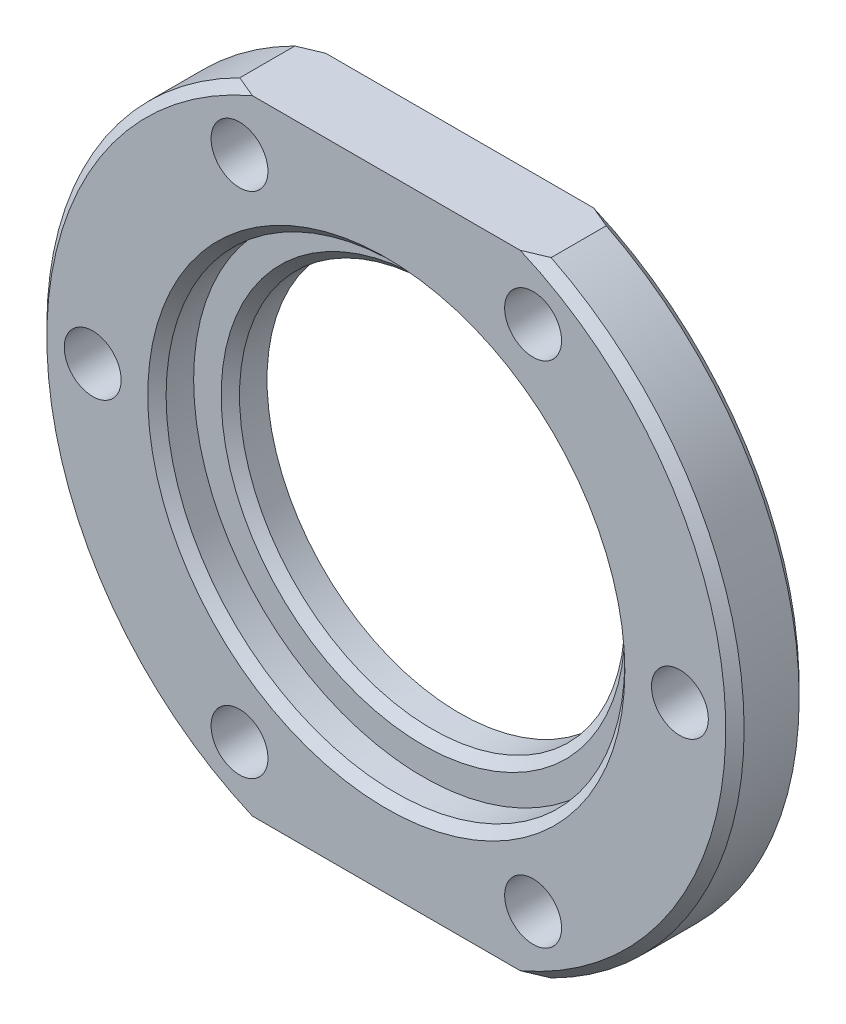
ISO-10303-21;
HEADER;
FILE_DESCRIPTION(('STEP AP214'),'2;1');
FILE_NAME('part.step','',(''),(''),'','','');
FILE_SCHEMA(('AUTOMOTIVE_DESIGN { 1 0 10303 214 1 1 1 1 }'));
ENDSEC;
DATA;
#1=APPLICATION_CONTEXT('core data for automotive mechanical design processes');
#2=APPLICATION_PROTOCOL_DEFINITION('international standard','automotive_design',2000,#1);
#3=PRODUCT_CONTEXT('',#1,'mechanical');
#4=PRODUCT('Part','Part','',(#3));
#5=PRODUCT_RELATED_PRODUCT_CATEGORY('part','',(#4));
#6=PRODUCT_DEFINITION_FORMATION('','',#4);
#7=PRODUCT_DEFINITION_CONTEXT('part definition',#1,'design');
#8=PRODUCT_DEFINITION('design','',#6,#7);
#9=PRODUCT_DEFINITION_SHAPE('','',#8);
#10=(LENGTH_UNIT() NAMED_UNIT(*) SI_UNIT(.MILLI.,.METRE.));
#11=(NAMED_UNIT(*) PLANE_ANGLE_UNIT() SI_UNIT($,.RADIAN.));
#12=(NAMED_UNIT(*) SI_UNIT($,.STERADIAN.) SOLID_ANGLE_UNIT());
#13=UNCERTAINTY_MEASURE_WITH_UNIT(LENGTH_MEASURE(1.E-05),#10,'distance_accuracy_value','');
#14=(GEOMETRIC_REPRESENTATION_CONTEXT(3) GLOBAL_UNCERTAINTY_ASSIGNED_CONTEXT((#13)) GLOBAL_UNIT_ASSIGNED_CONTEXT((#10,
#11,#12)) REPRESENTATION_CONTEXT('',''));
#15=CARTESIAN_POINT('',(0.,0.,0.));
#16=DIRECTION('',(0.,0.,1.));
#17=DIRECTION('',(1.,0.,0.));
#18=AXIS2_PLACEMENT_3D('',#15,#16,#17);
#19=CARTESIAN_POINT('',(0.,0.,4.));
#20=DIRECTION('',(0.,0.,-1.));
#21=DIRECTION('',(-1.,0.,0.));
#22=AXIS2_PLACEMENT_3D('',#19,#20,#21);
#23=CYLINDRICAL_SURFACE('',#22,18.9998743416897);
#24=DIRECTION('',(0.,0.,-1.));
#25=VECTOR('',#24,1.);
#26=CARTESIAN_POINT('',(-8.485,17.,4.));
#27=LINE('',#26,#25);
#28=CARTESIAN_POINT('',(-8.485,17.,3.49999999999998));
#29=VERTEX_POINT('',#28);
#30=CARTESIAN_POINT('',(-8.485,17.,0.500000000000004));
#31=VERTEX_POINT('',#30);
#32=EDGE_CURVE('E125',#29,#31,#27,.T.);
#33=ORIENTED_EDGE('',*,*,#32,.T.);
#34=CARTESIAN_POINT('',(0.,0.,0.500000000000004));
#35=DIRECTION('',(0.,0.,1.));
#36=DIRECTION('',(1.,0.,0.));
#37=AXIS2_PLACEMENT_3D('',#34,#35,#36);
#38=CIRCLE('',#37,18.9998743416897);
#39=CARTESIAN_POINT('',(-8.48500000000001,-17.,0.500000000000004));
#40=VERTEX_POINT('',#39);
#41=EDGE_CURVE('E235',#31,#40,#38,.T.);
#42=ORIENTED_EDGE('',*,*,#41,.T.);
#43=DIRECTION('',(0.,0.,-1.));
#44=VECTOR('',#43,1.);
#45=CARTESIAN_POINT('',(-8.48500000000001,-17.,4.));
#46=LINE('',#45,#44);
#47=CARTESIAN_POINT('',(-8.48500000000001,-17.,3.49999999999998));
#48=VERTEX_POINT('',#47);
#49=EDGE_CURVE('E130',#48,#40,#46,.T.);
#50=ORIENTED_EDGE('',*,*,#49,.F.);
#51=CARTESIAN_POINT('',(0.,0.,3.49999999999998));
#52=DIRECTION('',(0.,0.,1.));
#53=DIRECTION('',(1.,0.,0.));
#54=AXIS2_PLACEMENT_3D('',#51,#52,#53);
#55=CIRCLE('',#54,18.9998743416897);
#56=EDGE_CURVE('E234',#48,#29,#55,.F.);
#57=ORIENTED_EDGE('',*,*,#56,.T.);
#58=EDGE_LOOP('',(#33,#42,#50,#57));
#59=FACE_BOUND('',#58,.T.);
#60=ADVANCED_FACE('F35',(#59),#23,.T.);
#61=CARTESIAN_POINT('',(-8.48500000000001,-17.,4.));
#62=DIRECTION('',(0.,1.,0.));
#63=DIRECTION('',(0.,0.,1.));
#64=AXIS2_PLACEMENT_3D('',#61,#62,#63);
#65=PLANE('',#64);
#66=DIRECTION('',(1.,0.,0.));
#67=VECTOR('',#66,1.);
#68=CARTESIAN_POINT('',(-8.48500000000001,-17.,0.));
#69=LINE('',#68,#67);
#70=CARTESIAN_POINT('',(-7.29694118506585,-17.,0.));
#71=VERTEX_POINT('',#70);
#72=CARTESIAN_POINT('',(7.29694118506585,-17.,0.));
#73=VERTEX_POINT('',#72);
#74=EDGE_CURVE('E231',#71,#73,#69,.T.);
#75=ORIENTED_EDGE('',*,*,#74,.T.);
#76=CARTESIAN_POINT('',(7.29694118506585,-17.,0.));
#77=CARTESIAN_POINT('',(7.39687946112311,-17.,0.0394189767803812));
#78=CARTESIAN_POINT('',(7.49658395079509,-17.,0.0794293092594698));
#79=CARTESIAN_POINT('',(7.69551600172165,-17.,0.160584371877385));
#80=CARTESIAN_POINT('',(7.79474361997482,-17.,0.201728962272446));
#81=CARTESIAN_POINT('',(7.99273655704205,-17.,0.28511369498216));
#82=CARTESIAN_POINT('',(8.09150187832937,-17.,0.327353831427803));
#83=CARTESIAN_POINT('',(8.28858707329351,-17.,0.41289369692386));
#84=CARTESIAN_POINT('',(8.38690689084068,-17.,0.456193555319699));
#85=CARTESIAN_POINT('',(8.48500000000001,-17.,0.499999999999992));
#86=B_SPLINE_CURVE_WITH_KNOTS('',3,(#76,#77,#78,#79,#80,#81,#82,#83,#84,#85),.UNSPECIFIED.,.F.,
.F.,(4,2,2,2,4),(0.,0.32229172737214,0.644543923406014,0.966794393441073,1.28908439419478),.UNSPECIFIED.);
#87=CARTESIAN_POINT('',(8.485,-17.,0.500000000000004));
#88=VERTEX_POINT('',#87);
#89=EDGE_CURVE('E197',#73,#88,#86,.T.);
#90=ORIENTED_EDGE('',*,*,#89,.T.);
#91=DIRECTION('',(0.,0.,-1.));
#92=VECTOR('',#91,1.);
#93=CARTESIAN_POINT('',(8.485,-17.,4.));
#94=LINE('',#93,#92);
#95=CARTESIAN_POINT('',(8.485,-17.,3.49999999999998));
#96=VERTEX_POINT('',#95);
#97=EDGE_CURVE('E124',#96,#88,#94,.T.);
#98=ORIENTED_EDGE('',*,*,#97,.F.);
#99=CARTESIAN_POINT('',(8.485,-17.,3.49999999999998));
#100=CARTESIAN_POINT('',(8.38690689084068,-17.,3.54380644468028));
#101=CARTESIAN_POINT('',(8.2885870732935,-17.,3.58710630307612));
#102=CARTESIAN_POINT('',(8.09150187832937,-17.,3.67264616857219));
#103=CARTESIAN_POINT('',(7.99273655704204,-17.,3.71488630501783));
#104=CARTESIAN_POINT('',(7.7947436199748,-17.,3.79827103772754));
#105=CARTESIAN_POINT('',(7.69551600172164,-17.,3.8394156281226));
#106=CARTESIAN_POINT('',(7.49658395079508,-17.,3.92057069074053));
#107=CARTESIAN_POINT('',(7.3968794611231,-17.,3.96058102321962));
#108=CARTESIAN_POINT('',(7.29694118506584,-17.,4.00000000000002));
#109=B_SPLINE_CURVE_WITH_KNOTS('',3,(#99,#100,#101,#102,#103,#104,#105,#106,#107,#108),
.UNSPECIFIED.,.F.,.F.,(4,2,2,2,4),(0.,0.322290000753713,0.644540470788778,0.966792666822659,
1.2890843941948),.UNSPECIFIED.);
#110=CARTESIAN_POINT('',(7.29694118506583,-17.,4.));
#111=VERTEX_POINT('',#110);
#112=EDGE_CURVE('E129',#96,#111,#109,.T.);
#113=ORIENTED_EDGE('',*,*,#112,.T.);
#114=DIRECTION('',(1.,0.,0.));
#115=VECTOR('',#114,1.);
#116=CARTESIAN_POINT('',(-8.48500000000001,-17.,4.));
#117=LINE('',#116,#115);
#118=CARTESIAN_POINT('',(-7.29694118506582,-17.,4.));
#119=VERTEX_POINT('',#118);
#120=EDGE_CURVE('E230',#119,#111,#117,.T.);
#121=ORIENTED_EDGE('',*,*,#120,.F.);
#122=CARTESIAN_POINT('',(-7.29694118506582,-17.,4.));
#123=CARTESIAN_POINT('',(-7.39687946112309,-17.,3.96058102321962));
#124=CARTESIAN_POINT('',(-7.49658395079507,-17.,3.92057069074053));
#125=CARTESIAN_POINT('',(-7.69551600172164,-17.,3.83941562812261));
#126=CARTESIAN_POINT('',(-7.7947436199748,-17.,3.79827103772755));
#127=CARTESIAN_POINT('',(-7.99273655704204,-17.,3.71488630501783));
#128=CARTESIAN_POINT('',(-8.09150187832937,-17.,3.67264616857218));
#129=CARTESIAN_POINT('',(-8.28858707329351,-17.,3.58710630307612));
#130=CARTESIAN_POINT('',(-8.38690689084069,-17.,3.54380644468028));
#131=CARTESIAN_POINT('',(-8.48500000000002,-17.,3.49999999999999));
#132=B_SPLINE_CURVE_WITH_KNOTS('',3,(#122,#123,#124,#125,#126,#127,#128,#129,#130,#131),
.UNSPECIFIED.,.F.,.F.,(4,2,2,2,4),(0.,0.322291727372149,0.644543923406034,0.966794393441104,
1.28908439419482),.UNSPECIFIED.);
#133=EDGE_CURVE('E59',#119,#48,#132,.T.);
#134=ORIENTED_EDGE('',*,*,#133,.T.);
#135=ORIENTED_EDGE('',*,*,#49,.T.);
#136=CARTESIAN_POINT('',(-8.48500000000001,-17.,0.500000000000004));
#137=CARTESIAN_POINT('',(-8.38690689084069,-17.,0.456193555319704));
#138=CARTESIAN_POINT('',(-8.28858707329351,-17.,0.412893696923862));
#139=CARTESIAN_POINT('',(-8.09150187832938,-17.,0.327353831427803));
#140=CARTESIAN_POINT('',(-7.99273655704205,-17.,0.285113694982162));
#141=CARTESIAN_POINT('',(-7.79474361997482,-17.,0.20172896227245));
#142=CARTESIAN_POINT('',(-7.69551600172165,-17.,0.16058437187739));
#143=CARTESIAN_POINT('',(-7.49658395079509,-17.,0.0794293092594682));
#144=CARTESIAN_POINT('',(-7.39687946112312,-17.,0.0394189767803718));
#145=CARTESIAN_POINT('',(-7.29694118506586,-17.,0.));
#146=B_SPLINE_CURVE_WITH_KNOTS('',3,(#136,#137,#138,#139,#140,#141,#142,#143,#144,#145),
.UNSPECIFIED.,.F.,.F.,(4,2,2,2,4),(0.,0.322290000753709,0.64454047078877,0.966792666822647,
1.28908439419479),.UNSPECIFIED.);
#147=EDGE_CURVE('E51',#40,#71,#146,.T.);
#148=ORIENTED_EDGE('',*,*,#147,.T.);
#149=EDGE_LOOP('',(#75,#90,#98,#113,#121,#134,#135,#148));
#150=FACE_BOUND('',#149,.T.);
#151=ADVANCED_FACE('F208',(#150),#65,.F.);
#152=CARTESIAN_POINT('',(0.,0.,4.));
#153=DIRECTION('',(0.,0.,-1.));
#154=DIRECTION('',(-1.,0.,0.));
#155=AXIS2_PLACEMENT_3D('',#152,#153,#154);
#156=CYLINDRICAL_SURFACE('',#155,18.9998743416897);
#157=ORIENTED_EDGE('',*,*,#97,.T.);
#158=CARTESIAN_POINT('',(0.,0.,0.500000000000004));
#159=DIRECTION('',(0.,0.,1.));
#160=DIRECTION('',(1.,0.,0.));
#161=AXIS2_PLACEMENT_3D('',#158,#159,#160);
#162=CIRCLE('',#161,18.9998743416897);
#163=CARTESIAN_POINT('',(8.485,17.,0.500000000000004));
#164=VERTEX_POINT('',#163);
#165=EDGE_CURVE('E123',#88,#164,#162,.T.);
#166=ORIENTED_EDGE('',*,*,#165,.T.);
#167=DIRECTION('',(0.,0.,-1.));
#168=VECTOR('',#167,1.);
#169=CARTESIAN_POINT('',(8.485,17.,4.));
#170=LINE('',#169,#168);
#171=CARTESIAN_POINT('',(8.485,17.,3.49999999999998));
#172=VERTEX_POINT('',#171);
#173=EDGE_CURVE('E106',#172,#164,#170,.T.);
#174=ORIENTED_EDGE('',*,*,#173,.F.);
#175=CARTESIAN_POINT('',(0.,0.,3.49999999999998));
#176=DIRECTION('',(0.,0.,1.));
#177=DIRECTION('',(1.,0.,0.));
#178=AXIS2_PLACEMENT_3D('',#175,#176,#177);
#179=CIRCLE('',#178,18.9998743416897);
#180=EDGE_CURVE('E120',#172,#96,#179,.F.);
#181=ORIENTED_EDGE('',*,*,#180,.T.);
#182=EDGE_LOOP('',(#157,#166,#174,#181));
#183=FACE_BOUND('',#182,.T.);
#184=ADVANCED_FACE('F119',(#183),#156,.T.);
#185=CARTESIAN_POINT('',(-8.485,17.,4.));
#186=DIRECTION('',(0.,-1.,0.));
#187=DIRECTION('',(0.,0.,-1.));
#188=AXIS2_PLACEMENT_3D('',#185,#186,#187);
#189=PLANE('',#188);
#190=ORIENTED_EDGE('',*,*,#173,.T.);
#191=CARTESIAN_POINT('',(8.485,17.,0.500000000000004));
#192=CARTESIAN_POINT('',(8.38690689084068,17.,0.456193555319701));
#193=CARTESIAN_POINT('',(8.28858707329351,17.,0.412893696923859));
#194=CARTESIAN_POINT('',(8.09150187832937,17.,0.327353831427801));
#195=CARTESIAN_POINT('',(7.99273655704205,17.,0.285113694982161));
#196=CARTESIAN_POINT('',(7.79474361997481,17.,0.20172896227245));
#197=CARTESIAN_POINT('',(7.69551600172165,17.,0.16058437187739));
#198=CARTESIAN_POINT('',(7.49658395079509,17.,0.079429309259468));
#199=CARTESIAN_POINT('',(7.39687946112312,17.,0.0394189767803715));
#200=CARTESIAN_POINT('',(7.29694118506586,17.,0.));
#201=B_SPLINE_CURVE_WITH_KNOTS('',3,(#191,#192,#193,#194,#195,#196,#197,#198,#199,#200),
.UNSPECIFIED.,.F.,.F.,(4,2,2,2,4),(0.,0.322290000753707,0.644540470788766,0.96679266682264,
1.28908439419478),.UNSPECIFIED.);
#202=CARTESIAN_POINT('',(7.29694118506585,17.,0.));
#203=VERTEX_POINT('',#202);
#204=EDGE_CURVE('E170',#164,#203,#201,.T.);
#205=ORIENTED_EDGE('',*,*,#204,.T.);
#206=DIRECTION('',(-1.,0.,0.));
#207=VECTOR('',#206,1.);
#208=CARTESIAN_POINT('',(-8.485,17.,0.));
#209=LINE('',#208,#207);
#210=CARTESIAN_POINT('',(-7.29694118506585,17.,0.));
#211=VERTEX_POINT('',#210);
#212=EDGE_CURVE('E225',#203,#211,#209,.T.);
#213=ORIENTED_EDGE('',*,*,#212,.T.);
#214=CARTESIAN_POINT('',(-7.29694118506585,17.,0.));
#215=CARTESIAN_POINT('',(-7.39687946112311,17.,0.0394189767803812));
#216=CARTESIAN_POINT('',(-7.49658395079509,17.,0.0794293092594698));
#217=CARTESIAN_POINT('',(-7.69551600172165,17.,0.160584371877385));
#218=CARTESIAN_POINT('',(-7.79474361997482,17.,0.201728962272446));
#219=CARTESIAN_POINT('',(-7.99273655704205,17.,0.28511369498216));
#220=CARTESIAN_POINT('',(-8.09150187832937,17.,0.327353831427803));
#221=CARTESIAN_POINT('',(-8.28858707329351,17.,0.41289369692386));
#222=CARTESIAN_POINT('',(-8.38690689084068,17.,0.456193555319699));
#223=CARTESIAN_POINT('',(-8.48500000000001,17.,0.499999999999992));
#224=B_SPLINE_CURVE_WITH_KNOTS('',3,(#214,#215,#216,#217,#218,#219,#220,#221,#222,#223),
.UNSPECIFIED.,.F.,.F.,(4,2,2,2,4),(0.,0.32229172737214,0.644543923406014,0.966794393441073,
1.28908439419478),.UNSPECIFIED.);
#225=EDGE_CURVE('E113',#211,#31,#224,.T.);
#226=ORIENTED_EDGE('',*,*,#225,.T.);
#227=ORIENTED_EDGE('',*,*,#32,.F.);
#228=CARTESIAN_POINT('',(-8.485,17.,3.49999999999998));
#229=CARTESIAN_POINT('',(-8.38690689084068,17.,3.54380644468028));
#230=CARTESIAN_POINT('',(-8.2885870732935,17.,3.58710630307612));
#231=CARTESIAN_POINT('',(-8.09150187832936,17.,3.67264616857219));
#232=CARTESIAN_POINT('',(-7.99273655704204,17.,3.71488630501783));
#233=CARTESIAN_POINT('',(-7.7947436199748,17.,3.79827103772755));
#234=CARTESIAN_POINT('',(-7.69551600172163,17.,3.83941562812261));
#235=CARTESIAN_POINT('',(-7.49658395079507,17.,3.92057069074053));
#236=CARTESIAN_POINT('',(-7.39687946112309,17.,3.96058102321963));
#237=CARTESIAN_POINT('',(-7.29694118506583,17.,4.00000000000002));
#238=B_SPLINE_CURVE_WITH_KNOTS('',3,(#228,#229,#230,#231,#232,#233,#234,#235,#236,#237),
.UNSPECIFIED.,.F.,.F.,(4,2,2,2,4),(0.,0.322290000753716,0.644540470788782,0.966792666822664,
1.28908439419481),.UNSPECIFIED.);
#239=CARTESIAN_POINT('',(-7.29694118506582,17.,4.));
#240=VERTEX_POINT('',#239);
#241=EDGE_CURVE('E114',#29,#240,#238,.T.);
#242=ORIENTED_EDGE('',*,*,#241,.T.);
#243=DIRECTION('',(-1.,0.,0.));
#244=VECTOR('',#243,1.);
#245=CARTESIAN_POINT('',(-8.485,17.,4.));
#246=LINE('',#245,#244);
#247=CARTESIAN_POINT('',(7.29694118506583,17.,4.));
#248=VERTEX_POINT('',#247);
#249=EDGE_CURVE('E108',#248,#240,#246,.T.);
#250=ORIENTED_EDGE('',*,*,#249,.F.);
#251=CARTESIAN_POINT('',(7.29694118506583,17.,4.));
#252=CARTESIAN_POINT('',(7.3968794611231,17.,3.96058102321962));
#253=CARTESIAN_POINT('',(7.49658395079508,17.,3.92057069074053));
#254=CARTESIAN_POINT('',(7.69551600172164,17.,3.83941562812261));
#255=CARTESIAN_POINT('',(7.7947436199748,17.,3.79827103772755));
#256=CARTESIAN_POINT('',(7.99273655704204,17.,3.71488630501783));
#257=CARTESIAN_POINT('',(8.09150187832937,17.,3.67264616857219));
#258=CARTESIAN_POINT('',(8.2885870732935,17.,3.58710630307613));
#259=CARTESIAN_POINT('',(8.38690689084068,17.,3.54380644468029));
#260=CARTESIAN_POINT('',(8.48500000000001,17.,3.49999999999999));
#261=B_SPLINE_CURVE_WITH_KNOTS('',3,(#251,#252,#253,#254,#255,#256,#257,#258,#259,#260),
.UNSPECIFIED.,.F.,.F.,(4,2,2,2,4),(0.,0.322291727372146,0.644543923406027,0.96679439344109,
1.2890843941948),.UNSPECIFIED.);
#262=EDGE_CURVE('E103',#248,#172,#261,.T.);
#263=ORIENTED_EDGE('',*,*,#262,.T.);
#264=EDGE_LOOP('',(#190,#205,#213,#226,#227,#242,#250,#263));
#265=FACE_BOUND('',#264,.T.);
#266=ADVANCED_FACE('F105',(#265),#189,.F.);
#267=CARTESIAN_POINT('',(0.,0.,4.));
#268=DIRECTION('',(0.,0.,1.));
#269=DIRECTION('',(1.,0.,0.));
#270=AXIS2_PLACEMENT_3D('',#267,#268,#269);
#271=PLANE('',#270);
#272=CARTESIAN_POINT('',(0.,0.,4.));
#273=DIRECTION('',(0.,0.,1.));
#274=DIRECTION('',(1.,0.,0.));
#275=AXIS2_PLACEMENT_3D('',#272,#273,#274);
#276=CIRCLE('',#275,13.);
#277=CARTESIAN_POINT('',(13.,0.,4.));
#278=VERTEX_POINT('',#277);
#279=EDGE_CURVE('E240',#278,#278,#276,.F.);
#280=ORIENTED_EDGE('',*,*,#279,.T.);
#281=EDGE_LOOP('',(#280));
#282=FACE_BOUND('',#281,.T.);
#283=CARTESIAN_POINT('',(-16.,0.,4.));
#284=DIRECTION('',(0.,0.,1.));
#285=DIRECTION('',(1.,0.,0.));
#286=AXIS2_PLACEMENT_3D('',#283,#284,#285);
#287=CIRCLE('',#286,1.55);
#288=CARTESIAN_POINT('',(-14.45,0.,4.));
#289=VERTEX_POINT('',#288);
#290=EDGE_CURVE('E284',#289,#289,#287,.T.);
#291=ORIENTED_EDGE('',*,*,#290,.F.);
#292=EDGE_LOOP('',(#291));
#293=FACE_BOUND('',#292,.T.);
#294=CARTESIAN_POINT('',(-8.00000000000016,-13.8564064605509,4.));
#295=DIRECTION('',(0.,0.,1.));
#296=DIRECTION('',(1.,0.,0.));
#297=AXIS2_PLACEMENT_3D('',#294,#295,#296);
#298=CIRCLE('',#297,1.55);
#299=CARTESIAN_POINT('',(-6.45000000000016,-13.8564064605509,4.));
#300=VERTEX_POINT('',#299);
#301=EDGE_CURVE('E470',#300,#300,#298,.T.);
#302=ORIENTED_EDGE('',*,*,#301,.F.);
#303=EDGE_LOOP('',(#302));
#304=FACE_BOUND('',#303,.T.);
#305=CARTESIAN_POINT('',(7.99999999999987,-13.8564064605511,4.));
#306=DIRECTION('',(0.,0.,1.));
#307=DIRECTION('',(1.,0.,0.));
#308=AXIS2_PLACEMENT_3D('',#305,#306,#307);
#309=CIRCLE('',#308,1.55);
#310=CARTESIAN_POINT('',(9.54999999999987,-13.8564064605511,4.));
#311=VERTEX_POINT('',#310);
#312=EDGE_CURVE('E464',#311,#311,#309,.T.);
#313=ORIENTED_EDGE('',*,*,#312,.F.);
#314=EDGE_LOOP('',(#313));
#315=FACE_BOUND('',#314,.T.);
#316=CARTESIAN_POINT('',(16.,-1.1172740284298E-13,4.));
#317=DIRECTION('',(0.,0.,1.));
#318=DIRECTION('',(1.,0.,0.));
#319=AXIS2_PLACEMENT_3D('',#316,#317,#318);
#320=CIRCLE('',#319,1.55);
#321=CARTESIAN_POINT('',(17.55,-1.1172740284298E-13,4.));
#322=VERTEX_POINT('',#321);
#323=EDGE_CURVE('E453',#322,#322,#320,.T.);
#324=ORIENTED_EDGE('',*,*,#323,.F.);
#325=EDGE_LOOP('',(#324));
#326=FACE_BOUND('',#325,.T.);
#327=CARTESIAN_POINT('',(8.00000000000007,13.856406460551,4.));
#328=DIRECTION('',(0.,0.,1.));
#329=DIRECTION('',(1.,0.,0.));
#330=AXIS2_PLACEMENT_3D('',#327,#328,#329);
#331=CIRCLE('',#330,1.55);
#332=CARTESIAN_POINT('',(9.55000000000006,13.856406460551,4.));
#333=VERTEX_POINT('',#332);
#334=EDGE_CURVE('E463',#333,#333,#331,.T.);
#335=ORIENTED_EDGE('',*,*,#334,.F.);
#336=EDGE_LOOP('',(#335));
#337=FACE_BOUND('',#336,.T.);
#338=CARTESIAN_POINT('',(-7.99999999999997,13.856406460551,4.));
#339=DIRECTION('',(0.,0.,1.));
#340=DIRECTION('',(1.,0.,0.));
#341=AXIS2_PLACEMENT_3D('',#338,#339,#340);
#342=CIRCLE('',#341,1.55);
#343=CARTESIAN_POINT('',(-6.44999999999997,13.856406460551,4.));
#344=VERTEX_POINT('',#343);
#345=EDGE_CURVE('E467',#344,#344,#342,.T.);
#346=ORIENTED_EDGE('',*,*,#345,.F.);
#347=EDGE_LOOP('',(#346));
#348=FACE_BOUND('',#347,.T.);
#349=ORIENTED_EDGE('',*,*,#120,.T.);
#350=CARTESIAN_POINT('',(0.,0.,4.));
#351=DIRECTION('',(0.,0.,1.));
#352=DIRECTION('',(1.,0.,0.));
#353=AXIS2_PLACEMENT_3D('',#350,#351,#352);
#354=CIRCLE('',#353,18.4998743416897);
#355=EDGE_CURVE('E248',#111,#248,#354,.T.);
#356=ORIENTED_EDGE('',*,*,#355,.T.);
#357=ORIENTED_EDGE('',*,*,#249,.T.);
#358=CARTESIAN_POINT('',(0.,0.,4.));
#359=DIRECTION('',(0.,0.,1.));
#360=DIRECTION('',(1.,0.,0.));
#361=AXIS2_PLACEMENT_3D('',#358,#359,#360);
#362=CIRCLE('',#361,18.4998743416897);
#363=EDGE_CURVE('E245',#240,#119,#362,.T.);
#364=ORIENTED_EDGE('',*,*,#363,.T.);
#365=EDGE_LOOP('',(#349,#356,#357,#364));
#366=FACE_BOUND('',#365,.T.);
#367=ADVANCED_FACE('F157',(#282,#293,#304,#315,#326,#337,#348,#366),#271,.T.);
#368=CARTESIAN_POINT('',(0.,0.,0.));
#369=DIRECTION('',(0.,0.,1.));
#370=DIRECTION('',(1.,0.,0.));
#371=AXIS2_PLACEMENT_3D('',#368,#369,#370);
#372=PLANE('',#371);
#373=CARTESIAN_POINT('',(-16.,0.,0.));
#374=DIRECTION('',(0.,0.,1.));
#375=DIRECTION('',(1.,0.,0.));
#376=AXIS2_PLACEMENT_3D('',#373,#374,#375);
#377=CIRCLE('',#376,1.55);
#378=CARTESIAN_POINT('',(-14.45,0.,0.));
#379=VERTEX_POINT('',#378);
#380=EDGE_CURVE('E135',#379,#379,#377,.T.);
#381=ORIENTED_EDGE('',*,*,#380,.T.);
#382=EDGE_LOOP('',(#381));
#383=FACE_BOUND('',#382,.T.);
#384=CARTESIAN_POINT('',(-8.00000000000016,-13.8564064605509,0.));
#385=DIRECTION('',(0.,0.,1.));
#386=DIRECTION('',(1.,0.,0.));
#387=AXIS2_PLACEMENT_3D('',#384,#385,#386);
#388=CIRCLE('',#387,1.55);
#389=CARTESIAN_POINT('',(-6.45000000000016,-13.8564064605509,0.));
#390=VERTEX_POINT('',#389);
#391=EDGE_CURVE('E277',#390,#390,#388,.T.);
#392=ORIENTED_EDGE('',*,*,#391,.T.);
#393=EDGE_LOOP('',(#392));
#394=FACE_BOUND('',#393,.T.);
#395=CARTESIAN_POINT('',(7.99999999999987,-13.8564064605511,0.));
#396=DIRECTION('',(0.,0.,1.));
#397=DIRECTION('',(1.,0.,0.));
#398=AXIS2_PLACEMENT_3D('',#395,#396,#397);
#399=CIRCLE('',#398,1.55);
#400=CARTESIAN_POINT('',(9.54999999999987,-13.8564064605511,0.));
#401=VERTEX_POINT('',#400);
#402=EDGE_CURVE('E290',#401,#401,#399,.T.);
#403=ORIENTED_EDGE('',*,*,#402,.T.);
#404=EDGE_LOOP('',(#403));
#405=FACE_BOUND('',#404,.T.);
#406=CARTESIAN_POINT('',(16.,-1.1172740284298E-13,0.));
#407=DIRECTION('',(0.,0.,1.));
#408=DIRECTION('',(1.,0.,0.));
#409=AXIS2_PLACEMENT_3D('',#406,#407,#408);
#410=CIRCLE('',#409,1.55);
#411=CARTESIAN_POINT('',(17.55,-1.1172740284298E-13,0.));
#412=VERTEX_POINT('',#411);
#413=EDGE_CURVE('E287',#412,#412,#410,.T.);
#414=ORIENTED_EDGE('',*,*,#413,.T.);
#415=EDGE_LOOP('',(#414));
#416=FACE_BOUND('',#415,.T.);
#417=CARTESIAN_POINT('',(8.00000000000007,13.856406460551,0.));
#418=DIRECTION('',(0.,0.,1.));
#419=DIRECTION('',(1.,0.,0.));
#420=AXIS2_PLACEMENT_3D('',#417,#418,#419);
#421=CIRCLE('',#420,1.55);
#422=CARTESIAN_POINT('',(9.55000000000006,13.856406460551,0.));
#423=VERTEX_POINT('',#422);
#424=EDGE_CURVE('E283',#423,#423,#421,.T.);
#425=ORIENTED_EDGE('',*,*,#424,.T.);
#426=EDGE_LOOP('',(#425));
#427=FACE_BOUND('',#426,.T.);
#428=CARTESIAN_POINT('',(-7.99999999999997,13.856406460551,0.));
#429=DIRECTION('',(0.,0.,1.));
#430=DIRECTION('',(1.,0.,0.));
#431=AXIS2_PLACEMENT_3D('',#428,#429,#430);
#432=CIRCLE('',#431,1.55);
#433=CARTESIAN_POINT('',(-6.44999999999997,13.856406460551,0.));
#434=VERTEX_POINT('',#433);
#435=EDGE_CURVE('E280',#434,#434,#432,.T.);
#436=ORIENTED_EDGE('',*,*,#435,.T.);
#437=EDGE_LOOP('',(#436));
#438=FACE_BOUND('',#437,.T.);
#439=CARTESIAN_POINT('',(0.,0.,0.));
#440=DIRECTION('',(0.,0.,1.));
#441=DIRECTION('',(1.,0.,0.));
#442=AXIS2_PLACEMENT_3D('',#439,#440,#441);
#443=CIRCLE('',#442,10.5);
#444=CARTESIAN_POINT('',(10.5,0.,0.));
#445=VERTEX_POINT('',#444);
#446=EDGE_CURVE('E270',#445,#445,#443,.T.);
#447=ORIENTED_EDGE('',*,*,#446,.T.);
#448=EDGE_LOOP('',(#447));
#449=FACE_BOUND('',#448,.T.);
#450=ORIENTED_EDGE('',*,*,#212,.F.);
#451=CARTESIAN_POINT('',(0.,0.,0.));
#452=DIRECTION('',(0.,0.,1.));
#453=DIRECTION('',(1.,0.,0.));
#454=AXIS2_PLACEMENT_3D('',#451,#452,#453);
#455=CIRCLE('',#454,18.4998743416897);
#456=EDGE_CURVE('E219',#203,#73,#455,.F.);
#457=ORIENTED_EDGE('',*,*,#456,.T.);
#458=ORIENTED_EDGE('',*,*,#74,.F.);
#459=CARTESIAN_POINT('',(0.,0.,0.));
#460=DIRECTION('',(0.,0.,1.));
#461=DIRECTION('',(1.,0.,0.));
#462=AXIS2_PLACEMENT_3D('',#459,#460,#461);
#463=CIRCLE('',#462,18.4998743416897);
#464=EDGE_CURVE('E220',#71,#211,#463,.F.);
#465=ORIENTED_EDGE('',*,*,#464,.T.);
#466=EDGE_LOOP('',(#450,#457,#458,#465));
#467=FACE_BOUND('',#466,.T.);
#468=ADVANCED_FACE('F158',(#383,#394,#405,#416,#427,#438,#449,#467),#372,.F.);
#469=CARTESIAN_POINT('',(0.,0.,2.));
#470=DIRECTION('',(0.,0.,1.));
#471=DIRECTION('',(1.,0.,0.));
#472=AXIS2_PLACEMENT_3D('',#469,#470,#471);
#473=CYLINDRICAL_SURFACE('',#472,12.5);
#474=CARTESIAN_POINT('',(0.,0.,3.5));
#475=DIRECTION('',(0.,0.,1.));
#476=DIRECTION('',(1.,0.,0.));
#477=AXIS2_PLACEMENT_3D('',#474,#475,#476);
#478=CIRCLE('',#477,12.5);
#479=CARTESIAN_POINT('',(12.5,0.,3.5));
#480=VERTEX_POINT('',#479);
#481=EDGE_CURVE('E11',#480,#480,#478,.T.);
#482=ORIENTED_EDGE('',*,*,#481,.T.);
#483=EDGE_LOOP('',(#482));
#484=FACE_BOUND('',#483,.T.);
#485=CARTESIAN_POINT('',(0.,0.,2.));
#486=DIRECTION('',(0.,0.,1.));
#487=DIRECTION('',(1.,0.,0.));
#488=AXIS2_PLACEMENT_3D('',#485,#486,#487);
#489=CIRCLE('',#488,12.5);
#490=CARTESIAN_POINT('',(12.5,0.,2.));
#491=VERTEX_POINT('',#490);
#492=EDGE_CURVE('E272',#491,#491,#489,.T.);
#493=ORIENTED_EDGE('',*,*,#492,.F.);
#494=EDGE_LOOP('',(#493));
#495=FACE_BOUND('',#494,.T.);
#496=ADVANCED_FACE('F390',(#484,#495),#473,.F.);
#497=CARTESIAN_POINT('',(0.,0.,2.));
#498=DIRECTION('',(0.,0.,1.));
#499=DIRECTION('',(1.,0.,0.));
#500=AXIS2_PLACEMENT_3D('',#497,#498,#499);
#501=PLANE('',#500);
#502=CARTESIAN_POINT('',(0.,0.,2.));
#503=DIRECTION('',(0.,0.,1.));
#504=DIRECTION('',(1.,0.,0.));
#505=AXIS2_PLACEMENT_3D('',#502,#503,#504);
#506=CIRCLE('',#505,11.);
#507=CARTESIAN_POINT('',(11.,0.,2.));
#508=VERTEX_POINT('',#507);
#509=EDGE_CURVE('E44',#508,#508,#506,.F.);
#510=ORIENTED_EDGE('',*,*,#509,.T.);
#511=EDGE_LOOP('',(#510));
#512=FACE_BOUND('',#511,.T.);
#513=ORIENTED_EDGE('',*,*,#492,.T.);
#514=EDGE_LOOP('',(#513));
#515=FACE_BOUND('',#514,.T.);
#516=ADVANCED_FACE('F255',(#512,#515),#501,.T.);
#517=CARTESIAN_POINT('',(0.,0.,-10.));
#518=DIRECTION('',(0.,0.,1.));
#519=DIRECTION('',(1.,0.,0.));
#520=AXIS2_PLACEMENT_3D('',#517,#518,#519);
#521=CYLINDRICAL_SURFACE('',#520,10.5);
#522=CARTESIAN_POINT('',(0.,0.,1.5));
#523=DIRECTION('',(0.,0.,1.));
#524=DIRECTION('',(1.,0.,0.));
#525=AXIS2_PLACEMENT_3D('',#522,#523,#524);
#526=CIRCLE('',#525,10.5);
#527=CARTESIAN_POINT('',(10.5,0.,1.5));
#528=VERTEX_POINT('',#527);
#529=EDGE_CURVE('E250',#528,#528,#526,.T.);
#530=ORIENTED_EDGE('',*,*,#529,.T.);
#531=EDGE_LOOP('',(#530));
#532=FACE_BOUND('',#531,.T.);
#533=ORIENTED_EDGE('',*,*,#446,.F.);
#534=EDGE_LOOP('',(#533));
#535=FACE_BOUND('',#534,.T.);
#536=ADVANCED_FACE('F263',(#532,#535),#521,.F.);
#537=CARTESIAN_POINT('',(-7.99999999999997,13.856406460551,-8.));
#538=DIRECTION('',(0.,0.,1.));
#539=DIRECTION('',(1.,0.,0.));
#540=AXIS2_PLACEMENT_3D('',#537,#538,#539);
#541=CYLINDRICAL_SURFACE('',#540,1.55);
#542=ORIENTED_EDGE('',*,*,#345,.T.);
#543=EDGE_LOOP('',(#542));
#544=FACE_BOUND('',#543,.T.);
#545=ORIENTED_EDGE('',*,*,#435,.F.);
#546=EDGE_LOOP('',(#545));
#547=FACE_BOUND('',#546,.T.);
#548=ADVANCED_FACE('F266',(#544,#547),#541,.F.);
#549=CARTESIAN_POINT('',(8.00000000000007,13.856406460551,-8.));
#550=DIRECTION('',(0.,0.,1.));
#551=DIRECTION('',(1.,0.,0.));
#552=AXIS2_PLACEMENT_3D('',#549,#550,#551);
#553=CYLINDRICAL_SURFACE('',#552,1.55);
#554=ORIENTED_EDGE('',*,*,#334,.T.);
#555=EDGE_LOOP('',(#554));
#556=FACE_BOUND('',#555,.T.);
#557=ORIENTED_EDGE('',*,*,#424,.F.);
#558=EDGE_LOOP('',(#557));
#559=FACE_BOUND('',#558,.T.);
#560=ADVANCED_FACE('F421',(#556,#559),#553,.F.);
#561=CARTESIAN_POINT('',(16.,-1.1172740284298E-13,-8.));
#562=DIRECTION('',(0.,0.,1.));
#563=DIRECTION('',(1.,0.,0.));
#564=AXIS2_PLACEMENT_3D('',#561,#562,#563);
#565=CYLINDRICAL_SURFACE('',#564,1.55);
#566=ORIENTED_EDGE('',*,*,#323,.T.);
#567=EDGE_LOOP('',(#566));
#568=FACE_BOUND('',#567,.T.);
#569=ORIENTED_EDGE('',*,*,#413,.F.);
#570=EDGE_LOOP('',(#569));
#571=FACE_BOUND('',#570,.T.);
#572=ADVANCED_FACE('F309',(#568,#571),#565,.F.);
#573=CARTESIAN_POINT('',(7.99999999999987,-13.8564064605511,-8.));
#574=DIRECTION('',(0.,0.,1.));
#575=DIRECTION('',(1.,0.,0.));
#576=AXIS2_PLACEMENT_3D('',#573,#574,#575);
#577=CYLINDRICAL_SURFACE('',#576,1.55);
#578=ORIENTED_EDGE('',*,*,#312,.T.);
#579=EDGE_LOOP('',(#578));
#580=FACE_BOUND('',#579,.T.);
#581=ORIENTED_EDGE('',*,*,#402,.F.);
#582=EDGE_LOOP('',(#581));
#583=FACE_BOUND('',#582,.T.);
#584=ADVANCED_FACE('F300',(#580,#583),#577,.F.);
#585=CARTESIAN_POINT('',(-8.00000000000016,-13.8564064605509,-8.));
#586=DIRECTION('',(0.,0.,1.));
#587=DIRECTION('',(1.,0.,0.));
#588=AXIS2_PLACEMENT_3D('',#585,#586,#587);
#589=CYLINDRICAL_SURFACE('',#588,1.55);
#590=ORIENTED_EDGE('',*,*,#301,.T.);
#591=EDGE_LOOP('',(#590));
#592=FACE_BOUND('',#591,.T.);
#593=ORIENTED_EDGE('',*,*,#391,.F.);
#594=EDGE_LOOP('',(#593));
#595=FACE_BOUND('',#594,.T.);
#596=ADVANCED_FACE('F297',(#592,#595),#589,.F.);
#597=CARTESIAN_POINT('',(-16.,0.,-8.));
#598=DIRECTION('',(0.,0.,1.));
#599=DIRECTION('',(1.,0.,0.));
#600=AXIS2_PLACEMENT_3D('',#597,#598,#599);
#601=CYLINDRICAL_SURFACE('',#600,1.55);
#602=ORIENTED_EDGE('',*,*,#290,.T.);
#603=EDGE_LOOP('',(#602));
#604=FACE_BOUND('',#603,.T.);
#605=ORIENTED_EDGE('',*,*,#380,.F.);
#606=EDGE_LOOP('',(#605));
#607=FACE_BOUND('',#606,.T.);
#608=ADVANCED_FACE('F299',(#604,#607),#601,.F.);
#609=CARTESIAN_POINT('',(0.,0.,0.500000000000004));
#610=DIRECTION('',(0.,0.,1.));
#611=DIRECTION('',(1.,0.,0.));
#612=AXIS2_PLACEMENT_3D('',#609,#610,#611);
#613=CONICAL_SURFACE('',#612,18.9998743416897,0.785398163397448);
#614=ORIENTED_EDGE('',*,*,#89,.F.);
#615=ORIENTED_EDGE('',*,*,#456,.F.);
#616=ORIENTED_EDGE('',*,*,#204,.F.);
#617=ORIENTED_EDGE('',*,*,#165,.F.);
#618=EDGE_LOOP('',(#614,#615,#616,#617));
#619=FACE_BOUND('',#618,.T.);
#620=ADVANCED_FACE('F185',(#619),#613,.T.);
#621=CARTESIAN_POINT('',(0.,0.,0.500000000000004));
#622=DIRECTION('',(0.,0.,1.));
#623=DIRECTION('',(1.,0.,0.));
#624=AXIS2_PLACEMENT_3D('',#621,#622,#623);
#625=CONICAL_SURFACE('',#624,18.9998743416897,0.785398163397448);
#626=ORIENTED_EDGE('',*,*,#225,.F.);
#627=ORIENTED_EDGE('',*,*,#464,.F.);
#628=ORIENTED_EDGE('',*,*,#147,.F.);
#629=ORIENTED_EDGE('',*,*,#41,.F.);
#630=EDGE_LOOP('',(#626,#627,#628,#629));
#631=FACE_BOUND('',#630,.T.);
#632=ADVANCED_FACE('F178',(#631),#625,.T.);
#633=CARTESIAN_POINT('',(0.,0.,4.));
#634=DIRECTION('',(0.,0.,-1.));
#635=DIRECTION('',(-1.,0.,0.));
#636=AXIS2_PLACEMENT_3D('',#633,#634,#635);
#637=CONICAL_SURFACE('',#636,18.4998743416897,0.785398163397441);
#638=ORIENTED_EDGE('',*,*,#112,.F.);
#639=ORIENTED_EDGE('',*,*,#180,.F.);
#640=ORIENTED_EDGE('',*,*,#262,.F.);
#641=ORIENTED_EDGE('',*,*,#355,.F.);
#642=EDGE_LOOP('',(#638,#639,#640,#641));
#643=FACE_BOUND('',#642,.T.);
#644=ADVANCED_FACE('F128',(#643),#637,.T.);
#645=CARTESIAN_POINT('',(0.,0.,4.));
#646=DIRECTION('',(0.,0.,-1.));
#647=DIRECTION('',(-1.,0.,0.));
#648=AXIS2_PLACEMENT_3D('',#645,#646,#647);
#649=CONICAL_SURFACE('',#648,18.4998743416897,0.785398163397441);
#650=ORIENTED_EDGE('',*,*,#241,.F.);
#651=ORIENTED_EDGE('',*,*,#56,.F.);
#652=ORIENTED_EDGE('',*,*,#133,.F.);
#653=ORIENTED_EDGE('',*,*,#363,.F.);
#654=EDGE_LOOP('',(#650,#651,#652,#653));
#655=FACE_BOUND('',#654,.T.);
#656=ADVANCED_FACE('F151',(#655),#649,.T.);
#657=CARTESIAN_POINT('',(0.,0.,1.5));
#658=DIRECTION('',(0.,0.,1.));
#659=DIRECTION('',(1.,0.,0.));
#660=AXIS2_PLACEMENT_3D('',#657,#658,#659);
#661=CONICAL_SURFACE('',#660,10.5,0.785398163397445);
#662=ORIENTED_EDGE('',*,*,#509,.F.);
#663=EDGE_LOOP('',(#662));
#664=FACE_BOUND('',#663,.T.);
#665=ORIENTED_EDGE('',*,*,#529,.F.);
#666=EDGE_LOOP('',(#665));
#667=FACE_BOUND('',#666,.T.);
#668=ADVANCED_FACE('F258',(#664,#667),#661,.F.);
#669=CARTESIAN_POINT('',(0.,0.,3.5));
#670=DIRECTION('',(0.,0.,1.));
#671=DIRECTION('',(1.,0.,0.));
#672=AXIS2_PLACEMENT_3D('',#669,#670,#671);
#673=CONICAL_SURFACE('',#672,12.5,0.785398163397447);
#674=ORIENTED_EDGE('',*,*,#279,.F.);
#675=EDGE_LOOP('',(#674));
#676=FACE_BOUND('',#675,.T.);
#677=ORIENTED_EDGE('',*,*,#481,.F.);
#678=EDGE_LOOP('',(#677));
#679=FACE_BOUND('',#678,.T.);
#680=ADVANCED_FACE('F38',(#676,#679),#673,.F.);
#681=CLOSED_SHELL('',(#60,#151,#184,#266,#367,#468,#496,#516,#536,#548,#560,#572,#584,#596,#608,
#620,#632,#644,#656,#668,#680));
#682=MANIFOLD_SOLID_BREP('B2',#681);
#683=ADVANCED_BREP_SHAPE_REPRESENTATION('',(#18,#682),#14);
#684=SHAPE_DEFINITION_REPRESENTATION(#9,#683);
ENDSEC;
END-ISO-10303-21;
